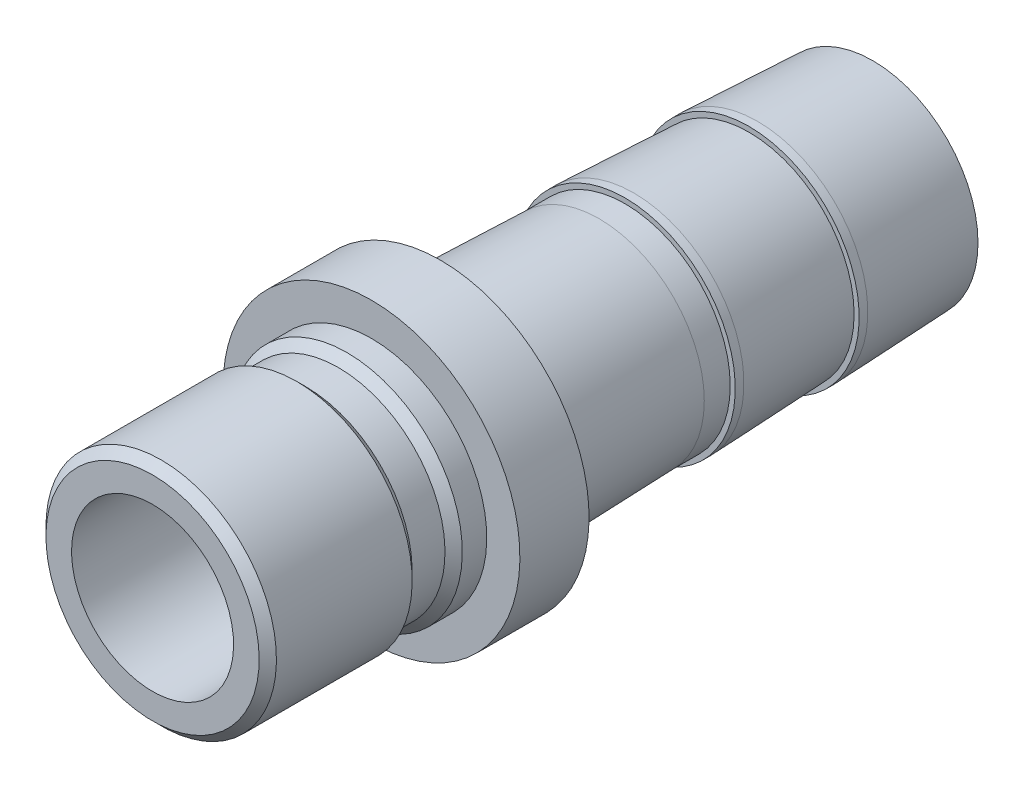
from build123d import *


with BuildPart() as part:
    # Sketch1 → Revolve1 (revolve)
    with BuildSketch(Plane(origin=(0, 0, 0), x_dir=(0, 0, -1), z_dir=(1, 0, 0))):
        Polygon((-19.304, 7.14375), (-19.304, 9.398), (-18.542, 10.16), (-6.5786, 10.16), (-5.8166, 9.398), (-2.921, 9.398), (-2.159, 10.16), (0, 10.16), (0, 13.081), (6.096, 13.081), (6.096, 9.7155), (20.066, 9.271), (22.352, 9.271), (22.352, 9.7155), (23.114, 9.7155), (33.274, 9.271), (33.274, 9.7155), (34.036, 9.7155), (44.196, 9.271), (44.196, 7.14375), align=None)
    revolve(axis=Axis((0, 0, 0), (0, 0, 1)))


solid = part.part
